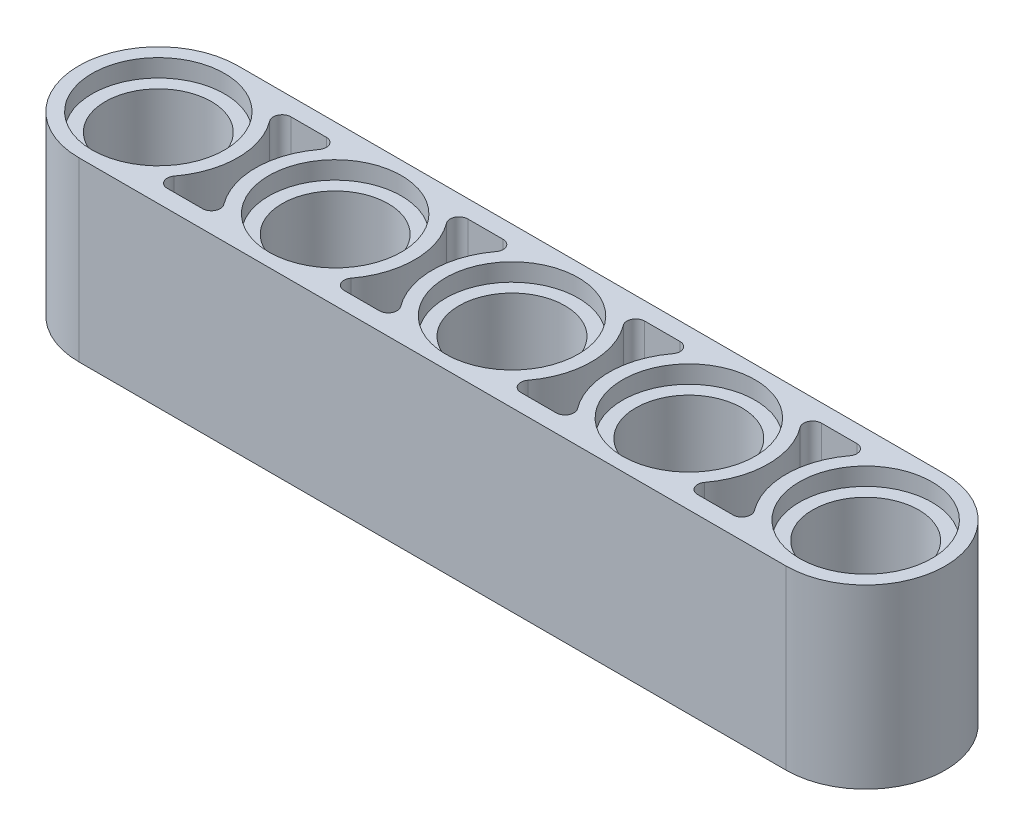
from build123d import *

# Parameters (mm, degrees)
SKETCH1_R           = 2.4
BOSS_EXTRUDE1_DEPTH = 8
SKETCH6_R           = 3
CUT_EXTRUDE4_DEPTH  = 0.8
CUT_EXTRUDE5_START  = -3.2
CUT_EXTRUDE5_DEPTH  = 3.2


with BuildPart() as part:
    # Sketch1 → Boss-Extrude1 (new body)
    with BuildSketch(Plane(origin=(0, 0, 0), x_dir=(1, 0, 0), z_dir=(0, 1, 0))):
        with BuildLine():
            Line((0, 3.6), (32, 3.6))
            ThreePointArc((32, 3.6), (35.6, 0), (32, -3.6))
            Line((32, -3.6), (0, -3.6))
            ThreePointArc((0, -3.6), (-3.6, 0), (0, 3.6))
        make_face()
        with Locations(Location((0, 0, 0), (0, 0, 270))):
            Circle(SKETCH1_R, mode=Mode.SUBTRACT)
        with Locations(Location((8, 0, 0), (0, 0, 270))):
            Circle(SKETCH1_R, mode=Mode.SUBTRACT)
        with Locations(Location((16, 0, 0), (0, 0, 270))):
            Circle(SKETCH1_R, mode=Mode.SUBTRACT)
        with Locations(Location((24, 0, 0), (0, 0, 270))):
            Circle(SKETCH1_R, mode=Mode.SUBTRACT)
        with Locations(Location((32, 0, 0), (0, 0, 270))):
            Circle(SKETCH1_R, mode=Mode.SUBTRACT)
    extrude(amount=BOSS_EXTRUDE1_DEPTH)

    # Sketch6 → Cut-Extrude4 (cut)
    with BuildSketch(Plane(origin=(0, 8, 0), x_dir=(1, 0, 0), z_dir=(0, 1, 0))):
        with Locations(Location((0, 0, 0), (0, 0, 270))):
            Circle(SKETCH6_R)
        with Locations(Location((8, 0, 0), (0, 0, 270))):
            Circle(SKETCH6_R)
        with Locations(Location((16, 0, 0), (0, 0, 270))):
            Circle(SKETCH6_R)
        with Locations(Location((24, 0, 0), (0, 0, 270))):
            Circle(SKETCH6_R)
        with Locations(Location((32, 0, 0), (0, 0, 270))):
            Circle(SKETCH6_R)
    cut_extrude4 = extrude(amount=-CUT_EXTRUDE4_DEPTH, mode=Mode.SUBTRACT)

    # Sketch7 → Cut-Extrude5 (cut)
    with BuildSketch(Plane(origin=(0, 8, 0), x_dir=(1, 0, 0), z_dir=(0, 1, 0)).offset(CUT_EXTRUDE5_START)):
        with BuildLine():
            Line((3.2, 2.8), (4.8, 2.8))
            ThreePointArc((4.8, 2.8), (5.157770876, 2.578885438), (5.12, 2.16))
            ThreePointArc((5.12, 2.16), (4.4, 0), (5.12, -2.16))
            ThreePointArc((5.12, -2.16), (5.157770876, -2.578885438), (4.8, -2.8))
            Line((4.8, -2.8), (3.2, -2.8))
            ThreePointArc((3.2, -2.8), (2.842229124, -2.578885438), (2.88, -2.16))
            ThreePointArc((2.88, -2.16), (3.6, 0), (2.88, 2.16))
            ThreePointArc((2.88, 2.16), (2.842229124, 2.578885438), (3.2, 2.8))
        make_face()
        with BuildLine():
            Line((11.2, 2.8), (12.8, 2.8))
            ThreePointArc((12.8, 2.8), (13.157770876, 2.578885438), (13.12, 2.16))
            ThreePointArc((13.12, 2.16), (12.4, 0), (13.12, -2.16))
            ThreePointArc((13.12, -2.16), (13.157770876, -2.578885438), (12.8, -2.8))
            Line((12.8, -2.8), (11.2, -2.8))
            ThreePointArc((11.2, -2.8), (10.842229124, -2.578885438), (10.88, -2.16))
            ThreePointArc((10.88, -2.16), (11.6, 0), (10.88, 2.16))
            ThreePointArc((10.88, 2.16), (10.842229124, 2.578885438), (11.2, 2.8))
        make_face()
        with BuildLine():
            Line((19.2, 2.8), (20.8, 2.8))
            ThreePointArc((20.8, 2.8), (21.157770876, 2.578885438), (21.12, 2.16))
            ThreePointArc((21.12, 2.16), (20.4, 0), (21.12, -2.16))
            ThreePointArc((21.12, -2.16), (21.157770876, -2.578885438), (20.8, -2.8))
            Line((20.8, -2.8), (19.2, -2.8))
            ThreePointArc((19.2, -2.8), (18.842229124, -2.578885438), (18.88, -2.16))
            ThreePointArc((18.88, -2.16), (19.6, 0), (18.88, 2.16))
            ThreePointArc((18.88, 2.16), (18.842229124, 2.578885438), (19.2, 2.8))
        make_face()
        with BuildLine():
            Line((27.2, 2.8), (28.8, 2.8))
            ThreePointArc((28.8, 2.8), (29.157770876, 2.578885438), (29.12, 2.16))
            ThreePointArc((29.12, 2.16), (28.4, 0), (29.12, -2.16))
            ThreePointArc((29.12, -2.16), (29.157770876, -2.578885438), (28.8, -2.8))
            Line((28.8, -2.8), (27.2, -2.8))
            ThreePointArc((27.2, -2.8), (26.842229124, -2.578885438), (26.88, -2.16))
            ThreePointArc((26.88, -2.16), (27.6, 0), (26.88, 2.16))
            ThreePointArc((26.88, 2.16), (26.842229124, 2.578885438), (27.2, 2.8))
        make_face()
    cut_extrude5 = extrude(amount=CUT_EXTRUDE5_DEPTH, mode=Mode.SUBTRACT)

    # Mirror2: Cut-Extrude4, Cut-Extrude5 across plane
    add(cut_extrude4.mirror(Plane.ZX.offset(4)), mode=Mode.SUBTRACT)
    add(cut_extrude5.mirror(Plane.ZX.offset(4)), mode=Mode.SUBTRACT)


solid = part.part
